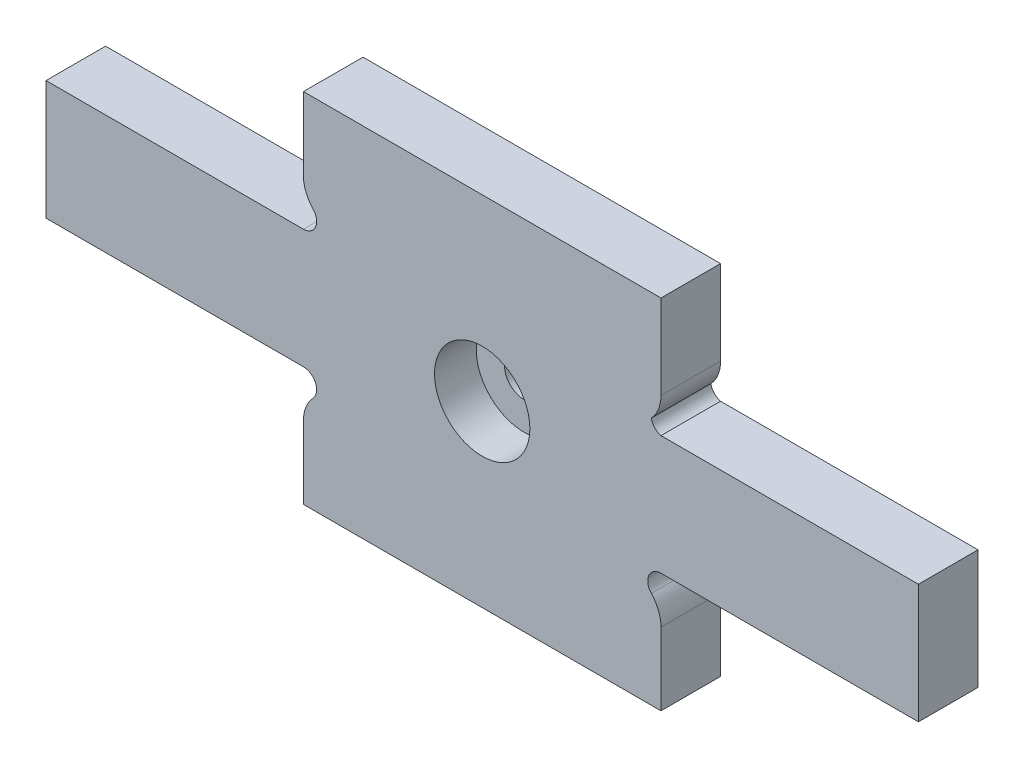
ISO-10303-21;
HEADER;
FILE_DESCRIPTION(('STEP AP214'),'2;1');
FILE_NAME('part.step','',(''),(''),'','','');
FILE_SCHEMA(('AUTOMOTIVE_DESIGN { 1 0 10303 214 1 1 1 1 }'));
ENDSEC;
DATA;
#1=APPLICATION_CONTEXT('core data for automotive mechanical design processes');
#2=APPLICATION_PROTOCOL_DEFINITION('international standard','automotive_design',2000,#1);
#3=PRODUCT_CONTEXT('',#1,'mechanical');
#4=PRODUCT('Part','Part','',(#3));
#5=PRODUCT_RELATED_PRODUCT_CATEGORY('part','',(#4));
#6=PRODUCT_DEFINITION_FORMATION('','',#4);
#7=PRODUCT_DEFINITION_CONTEXT('part definition',#1,'design');
#8=PRODUCT_DEFINITION('design','',#6,#7);
#9=PRODUCT_DEFINITION_SHAPE('','',#8);
#10=(LENGTH_UNIT() NAMED_UNIT(*) SI_UNIT(.MILLI.,.METRE.));
#11=(NAMED_UNIT(*) PLANE_ANGLE_UNIT() SI_UNIT($,.RADIAN.));
#12=(NAMED_UNIT(*) SI_UNIT($,.STERADIAN.) SOLID_ANGLE_UNIT());
#13=UNCERTAINTY_MEASURE_WITH_UNIT(LENGTH_MEASURE(1.E-05),#10,'distance_accuracy_value','');
#14=(GEOMETRIC_REPRESENTATION_CONTEXT(3) GLOBAL_UNCERTAINTY_ASSIGNED_CONTEXT((#13)) GLOBAL_UNIT_ASSIGNED_CONTEXT((#10,
#11,#12)) REPRESENTATION_CONTEXT('',''));
#15=CARTESIAN_POINT('',(0.,0.,0.));
#16=DIRECTION('',(0.,0.,1.));
#17=DIRECTION('',(1.,0.,0.));
#18=AXIS2_PLACEMENT_3D('',#15,#16,#17);
#19=CARTESIAN_POINT('',(0.,0.,0.));
#20=DIRECTION('',(0.,0.,1.));
#21=DIRECTION('',(1.,0.,0.));
#22=AXIS2_PLACEMENT_3D('',#19,#20,#21);
#23=CYLINDRICAL_SURFACE('',#22,3.25);
#24=CARTESIAN_POINT('',(0.,0.,0.));
#25=DIRECTION('',(0.,0.,1.));
#26=DIRECTION('',(1.,0.,0.));
#27=AXIS2_PLACEMENT_3D('',#24,#25,#26);
#28=CIRCLE('',#27,3.25);
#29=CARTESIAN_POINT('',(3.25,0.,0.));
#30=VERTEX_POINT('',#29);
#31=EDGE_CURVE('E225',#30,#30,#28,.T.);
#32=ORIENTED_EDGE('',*,*,#31,.F.);
#33=EDGE_LOOP('',(#32));
#34=FACE_BOUND('',#33,.T.);
#35=CARTESIAN_POINT('',(0.,0.,3.));
#36=DIRECTION('',(0.,0.,1.));
#37=DIRECTION('',(1.,0.,0.));
#38=AXIS2_PLACEMENT_3D('',#35,#36,#37);
#39=CIRCLE('',#38,3.25);
#40=CARTESIAN_POINT('',(3.25,0.,3.));
#41=VERTEX_POINT('',#40);
#42=EDGE_CURVE('E49',#41,#41,#39,.F.);
#43=ORIENTED_EDGE('',*,*,#42,.F.);
#44=EDGE_LOOP('',(#43));
#45=FACE_BOUND('',#44,.T.);
#46=ADVANCED_FACE('F45',(#34,#45),#23,.F.);
#47=CARTESIAN_POINT('',(30.0000000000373,-12.2200000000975,10.));
#48=DIRECTION('',(0.,0.,-1.));
#49=DIRECTION('',(-1.,0.,0.));
#50=AXIS2_PLACEMENT_3D('',#47,#48,#49);
#51=CYLINDRICAL_SURFACE('',#50,2.22000000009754);
#52=CARTESIAN_POINT('',(30.0000000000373,-12.2200000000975,0.));
#53=DIRECTION('',(0.,0.,-1.));
#54=DIRECTION('',(1.,0.,0.));
#55=AXIS2_PLACEMENT_3D('',#52,#53,#54);
#56=CIRCLE('',#55,2.22000000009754);
#57=CARTESIAN_POINT('',(28.3795620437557,-13.7374257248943,0.));
#58=VERTEX_POINT('',#57);
#59=CARTESIAN_POINT('',(30.0000000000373,-10.,0.));
#60=VERTEX_POINT('',#59);
#61=EDGE_CURVE('E220',#58,#60,#56,.T.);
#62=ORIENTED_EDGE('',*,*,#61,.T.);
#63=DIRECTION('',(0.,0.,-1.));
#64=VECTOR('',#63,1.);
#65=CARTESIAN_POINT('',(30.0000000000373,-10.,10.));
#66=LINE('',#65,#64);
#67=CARTESIAN_POINT('',(30.0000000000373,-10.,10.));
#68=VERTEX_POINT('',#67);
#69=EDGE_CURVE('E11',#68,#60,#66,.T.);
#70=ORIENTED_EDGE('',*,*,#69,.F.);
#71=CARTESIAN_POINT('',(30.0000000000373,-12.2200000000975,10.));
#72=DIRECTION('',(0.,0.,-1.));
#73=DIRECTION('',(1.,0.,0.));
#74=AXIS2_PLACEMENT_3D('',#71,#72,#73);
#75=CIRCLE('',#74,2.22000000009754);
#76=CARTESIAN_POINT('',(28.3795620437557,-13.7374257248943,10.));
#77=VERTEX_POINT('',#76);
#78=EDGE_CURVE('E279',#77,#68,#75,.T.);
#79=ORIENTED_EDGE('',*,*,#78,.F.);
#80=DIRECTION('',(0.,0.,-1.));
#81=VECTOR('',#80,1.);
#82=CARTESIAN_POINT('',(28.3795620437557,-13.7374257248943,10.));
#83=LINE('',#82,#81);
#84=EDGE_CURVE('E216',#77,#58,#83,.T.);
#85=ORIENTED_EDGE('',*,*,#84,.T.);
#86=EDGE_LOOP('',(#62,#70,#79,#85));
#87=FACE_BOUND('',#86,.T.);
#88=ADVANCED_FACE('F47',(#87),#51,.F.);
#89=CARTESIAN_POINT('',(30.0000000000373,-10.,10.));
#90=DIRECTION('',(0.,1.,0.));
#91=DIRECTION('',(-1.,0.,0.));
#92=AXIS2_PLACEMENT_3D('',#89,#90,#91);
#93=PLANE('',#92);
#94=DIRECTION('',(1.,0.,0.));
#95=VECTOR('',#94,1.);
#96=CARTESIAN_POINT('',(30.0000000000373,-10.,0.));
#97=LINE('',#96,#95);
#98=CARTESIAN_POINT('',(73.2000000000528,-9.99999999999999,0.));
#99=VERTEX_POINT('',#98);
#100=EDGE_CURVE('E224',#60,#99,#97,.T.);
#101=ORIENTED_EDGE('',*,*,#100,.T.);
#102=DIRECTION('',(0.,0.,-1.));
#103=VECTOR('',#102,1.);
#104=CARTESIAN_POINT('',(73.2000000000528,-9.99999999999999,10.));
#105=LINE('',#104,#103);
#106=CARTESIAN_POINT('',(73.2000000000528,-9.99999999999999,10.));
#107=VERTEX_POINT('',#106);
#108=EDGE_CURVE('E56',#107,#99,#105,.T.);
#109=ORIENTED_EDGE('',*,*,#108,.F.);
#110=DIRECTION('',(1.,0.,0.));
#111=VECTOR('',#110,1.);
#112=CARTESIAN_POINT('',(30.0000000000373,-10.,10.));
#113=LINE('',#112,#111);
#114=EDGE_CURVE('E143',#68,#107,#113,.T.);
#115=ORIENTED_EDGE('',*,*,#114,.F.);
#116=ORIENTED_EDGE('',*,*,#69,.T.);
#117=EDGE_LOOP('',(#101,#109,#115,#116));
#118=FACE_BOUND('',#117,.T.);
#119=ADVANCED_FACE('F437',(#118),#93,.F.);
#120=CARTESIAN_POINT('',(73.2000000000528,-9.99999999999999,10.));
#121=DIRECTION('',(-1.,0.,0.));
#122=DIRECTION('',(0.,0.,1.));
#123=AXIS2_PLACEMENT_3D('',#120,#121,#122);
#124=PLANE('',#123);
#125=DIRECTION('',(0.,1.,0.));
#126=VECTOR('',#125,1.);
#127=CARTESIAN_POINT('',(73.2000000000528,-9.99999999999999,0.));
#128=LINE('',#127,#126);
#129=CARTESIAN_POINT('',(73.2000000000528,10.,0.));
#130=VERTEX_POINT('',#129);
#131=EDGE_CURVE('E228',#99,#130,#128,.T.);
#132=ORIENTED_EDGE('',*,*,#131,.T.);
#133=DIRECTION('',(0.,0.,-1.));
#134=VECTOR('',#133,1.);
#135=CARTESIAN_POINT('',(73.2000000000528,10.,10.));
#136=LINE('',#135,#134);
#137=CARTESIAN_POINT('',(73.2000000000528,10.,10.));
#138=VERTEX_POINT('',#137);
#139=EDGE_CURVE('E338',#138,#130,#136,.T.);
#140=ORIENTED_EDGE('',*,*,#139,.F.);
#141=DIRECTION('',(0.,1.,0.));
#142=VECTOR('',#141,1.);
#143=CARTESIAN_POINT('',(73.2000000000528,-9.99999999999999,10.));
#144=LINE('',#143,#142);
#145=EDGE_CURVE('E349',#107,#138,#144,.T.);
#146=ORIENTED_EDGE('',*,*,#145,.F.);
#147=ORIENTED_EDGE('',*,*,#108,.T.);
#148=EDGE_LOOP('',(#132,#140,#146,#147));
#149=FACE_BOUND('',#148,.T.);
#150=ADVANCED_FACE('F347',(#149),#124,.F.);
#151=CARTESIAN_POINT('',(73.2000000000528,10.,10.));
#152=DIRECTION('',(0.,-1.,0.));
#153=DIRECTION('',(1.,0.,0.));
#154=AXIS2_PLACEMENT_3D('',#151,#152,#153);
#155=PLANE('',#154);
#156=DIRECTION('',(-1.,0.,0.));
#157=VECTOR('',#156,1.);
#158=CARTESIAN_POINT('',(73.2000000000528,10.,0.));
#159=LINE('',#158,#157);
#160=CARTESIAN_POINT('',(30.0000000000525,10.,0.));
#161=VERTEX_POINT('',#160);
#162=EDGE_CURVE('E231',#130,#161,#159,.T.);
#163=ORIENTED_EDGE('',*,*,#162,.T.);
#164=DIRECTION('',(0.,0.,-1.));
#165=VECTOR('',#164,1.);
#166=CARTESIAN_POINT('',(30.0000000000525,10.,10.));
#167=LINE('',#166,#165);
#168=CARTESIAN_POINT('',(30.0000000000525,10.,10.));
#169=VERTEX_POINT('',#168);
#170=EDGE_CURVE('E334',#169,#161,#167,.T.);
#171=ORIENTED_EDGE('',*,*,#170,.F.);
#172=DIRECTION('',(-1.,0.,0.));
#173=VECTOR('',#172,1.);
#174=CARTESIAN_POINT('',(73.2000000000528,10.,10.));
#175=LINE('',#174,#173);
#176=EDGE_CURVE('E368',#138,#169,#175,.T.);
#177=ORIENTED_EDGE('',*,*,#176,.F.);
#178=ORIENTED_EDGE('',*,*,#139,.T.);
#179=EDGE_LOOP('',(#163,#171,#177,#178));
#180=FACE_BOUND('',#179,.T.);
#181=ADVANCED_FACE('F358',(#180),#155,.F.);
#182=CARTESIAN_POINT('',(30.5612892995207,12.1478720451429,10.));
#183=DIRECTION('',(0.,0.,-1.));
#184=DIRECTION('',(-1.,0.,0.));
#185=AXIS2_PLACEMENT_3D('',#182,#183,#184);
#186=CYLINDRICAL_SURFACE('',#185,2.22000000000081);
#187=CARTESIAN_POINT('',(30.5612892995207,12.1478720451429,0.));
#188=DIRECTION('',(0.,0.,-1.));
#189=DIRECTION('',(1.,0.,0.));
#190=AXIS2_PLACEMENT_3D('',#187,#188,#189);
#191=CIRCLE('',#190,2.22000000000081);
#192=CARTESIAN_POINT('',(28.3795620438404,11.7374257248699,0.));
#193=VERTEX_POINT('',#192);
#194=EDGE_CURVE('E234',#161,#193,#191,.T.);
#195=ORIENTED_EDGE('',*,*,#194,.T.);
#196=DIRECTION('',(0.,0.,-1.));
#197=VECTOR('',#196,1.);
#198=CARTESIAN_POINT('',(28.3795620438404,11.7374257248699,10.));
#199=LINE('',#198,#197);
#200=CARTESIAN_POINT('',(28.3795620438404,11.7374257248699,10.));
#201=VERTEX_POINT('',#200);
#202=EDGE_CURVE('E330',#201,#193,#199,.T.);
#203=ORIENTED_EDGE('',*,*,#202,.F.);
#204=CARTESIAN_POINT('',(30.5612892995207,12.1478720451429,10.));
#205=DIRECTION('',(0.,0.,-1.));
#206=DIRECTION('',(1.,0.,0.));
#207=AXIS2_PLACEMENT_3D('',#204,#205,#206);
#208=CIRCLE('',#207,2.22000000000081);
#209=EDGE_CURVE('E364',#169,#201,#208,.T.);
#210=ORIENTED_EDGE('',*,*,#209,.F.);
#211=ORIENTED_EDGE('',*,*,#170,.T.);
#212=EDGE_LOOP('',(#195,#203,#210,#211));
#213=FACE_BOUND('',#212,.T.);
#214=ADVANCED_FACE('F362',(#213),#186,.F.);
#215=CARTESIAN_POINT('',(24.0000000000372,15.8385763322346,10.));
#216=DIRECTION('',(0.,0.,-1.));
#217=DIRECTION('',(-1.,0.,0.));
#218=AXIS2_PLACEMENT_3D('',#215,#216,#217);
#219=CYLINDRICAL_SURFACE('',#218,5.99999999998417);
#220=CARTESIAN_POINT('',(24.0000000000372,15.8385763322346,0.));
#221=DIRECTION('',(0.,0.,1.));
#222=DIRECTION('',(1.,0.,0.));
#223=AXIS2_PLACEMENT_3D('',#220,#221,#222);
#224=CIRCLE('',#223,5.99999999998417);
#225=CARTESIAN_POINT('',(30.0000000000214,15.8385763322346,0.));
#226=VERTEX_POINT('',#225);
#227=EDGE_CURVE('E237',#193,#226,#224,.T.);
#228=ORIENTED_EDGE('',*,*,#227,.T.);
#229=DIRECTION('',(0.,0.,-1.));
#230=VECTOR('',#229,1.);
#231=CARTESIAN_POINT('',(30.0000000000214,15.8385763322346,10.));
#232=LINE('',#231,#230);
#233=CARTESIAN_POINT('',(30.0000000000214,15.8385763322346,10.));
#234=VERTEX_POINT('',#233);
#235=EDGE_CURVE('E326',#234,#226,#232,.T.);
#236=ORIENTED_EDGE('',*,*,#235,.F.);
#237=CARTESIAN_POINT('',(24.0000000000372,15.8385763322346,10.));
#238=DIRECTION('',(0.,0.,1.));
#239=DIRECTION('',(1.,0.,0.));
#240=AXIS2_PLACEMENT_3D('',#237,#238,#239);
#241=CIRCLE('',#240,5.99999999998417);
#242=EDGE_CURVE('E367',#201,#234,#241,.T.);
#243=ORIENTED_EDGE('',*,*,#242,.F.);
#244=ORIENTED_EDGE('',*,*,#202,.T.);
#245=EDGE_LOOP('',(#228,#236,#243,#244));
#246=FACE_BOUND('',#245,.T.);
#247=ADVANCED_FACE('F620',(#246),#219,.T.);
#248=CARTESIAN_POINT('',(30.0000000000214,15.8385763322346,10.));
#249=DIRECTION('',(-1.,0.,0.));
#250=DIRECTION('',(0.,0.,1.));
#251=AXIS2_PLACEMENT_3D('',#248,#249,#250);
#252=PLANE('',#251);
#253=DIRECTION('',(0.,1.,0.));
#254=VECTOR('',#253,1.);
#255=CARTESIAN_POINT('',(30.0000000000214,15.8385763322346,0.));
#256=LINE('',#255,#254);
#257=CARTESIAN_POINT('',(30.0000000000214,30.,0.));
#258=VERTEX_POINT('',#257);
#259=EDGE_CURVE('E240',#226,#258,#256,.T.);
#260=ORIENTED_EDGE('',*,*,#259,.T.);
#261=DIRECTION('',(0.,0.,-1.));
#262=VECTOR('',#261,1.);
#263=CARTESIAN_POINT('',(30.0000000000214,30.,10.));
#264=LINE('',#263,#262);
#265=CARTESIAN_POINT('',(30.0000000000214,30.,10.));
#266=VERTEX_POINT('',#265);
#267=EDGE_CURVE('E322',#266,#258,#264,.T.);
#268=ORIENTED_EDGE('',*,*,#267,.F.);
#269=DIRECTION('',(0.,1.,0.));
#270=VECTOR('',#269,1.);
#271=CARTESIAN_POINT('',(30.0000000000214,15.8385763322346,10.));
#272=LINE('',#271,#270);
#273=EDGE_CURVE('E372',#234,#266,#272,.T.);
#274=ORIENTED_EDGE('',*,*,#273,.F.);
#275=ORIENTED_EDGE('',*,*,#235,.T.);
#276=EDGE_LOOP('',(#260,#268,#274,#275));
#277=FACE_BOUND('',#276,.T.);
#278=ADVANCED_FACE('F610',(#277),#252,.F.);
#279=CARTESIAN_POINT('',(30.0000000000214,30.,10.));
#280=DIRECTION('',(0.,-1.,0.));
#281=DIRECTION('',(0.,0.,-1.));
#282=AXIS2_PLACEMENT_3D('',#279,#280,#281);
#283=PLANE('',#282);
#284=DIRECTION('',(-1.,0.,0.));
#285=VECTOR('',#284,1.);
#286=CARTESIAN_POINT('',(30.0000000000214,30.,0.));
#287=LINE('',#286,#285);
#288=CARTESIAN_POINT('',(-30.,30.,0.));
#289=VERTEX_POINT('',#288);
#290=EDGE_CURVE('E243',#258,#289,#287,.T.);
#291=ORIENTED_EDGE('',*,*,#290,.T.);
#292=DIRECTION('',(0.,0.,-1.));
#293=VECTOR('',#292,1.);
#294=CARTESIAN_POINT('',(-30.,30.,10.));
#295=LINE('',#294,#293);
#296=CARTESIAN_POINT('',(-30.,30.,10.));
#297=VERTEX_POINT('',#296);
#298=EDGE_CURVE('E318',#297,#289,#295,.T.);
#299=ORIENTED_EDGE('',*,*,#298,.F.);
#300=DIRECTION('',(-1.,0.,0.));
#301=VECTOR('',#300,1.);
#302=CARTESIAN_POINT('',(30.0000000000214,30.,10.));
#303=LINE('',#302,#301);
#304=EDGE_CURVE('E379',#266,#297,#303,.T.);
#305=ORIENTED_EDGE('',*,*,#304,.F.);
#306=ORIENTED_EDGE('',*,*,#267,.T.);
#307=EDGE_LOOP('',(#291,#299,#305,#306));
#308=FACE_BOUND('',#307,.T.);
#309=ADVANCED_FACE('F600',(#308),#283,.F.);
#310=CARTESIAN_POINT('',(-30.,30.,10.));
#311=DIRECTION('',(1.,0.,0.));
#312=DIRECTION('',(0.,0.,-1.));
#313=AXIS2_PLACEMENT_3D('',#310,#311,#312);
#314=PLANE('',#313);
#315=DIRECTION('',(0.,-1.,0.));
#316=VECTOR('',#315,1.);
#317=CARTESIAN_POINT('',(-30.,30.,0.));
#318=LINE('',#317,#316);
#319=CARTESIAN_POINT('',(-30.,17.3740036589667,0.));
#320=VERTEX_POINT('',#319);
#321=EDGE_CURVE('E246',#289,#320,#318,.T.);
#322=ORIENTED_EDGE('',*,*,#321,.T.);
#323=DIRECTION('',(0.,0.,-1.));
#324=VECTOR('',#323,1.);
#325=CARTESIAN_POINT('',(-30.,17.3740036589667,10.));
#326=LINE('',#325,#324);
#327=CARTESIAN_POINT('',(-30.,17.3740036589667,10.));
#328=VERTEX_POINT('',#327);
#329=EDGE_CURVE('E314',#328,#320,#326,.T.);
#330=ORIENTED_EDGE('',*,*,#329,.F.);
#331=DIRECTION('',(0.,-1.,0.));
#332=VECTOR('',#331,1.);
#333=CARTESIAN_POINT('',(-30.,30.,10.));
#334=LINE('',#333,#332);
#335=EDGE_CURVE('E382',#297,#328,#334,.T.);
#336=ORIENTED_EDGE('',*,*,#335,.F.);
#337=ORIENTED_EDGE('',*,*,#298,.T.);
#338=EDGE_LOOP('',(#322,#330,#336,#337));
#339=FACE_BOUND('',#338,.T.);
#340=ADVANCED_FACE('F590',(#339),#314,.F.);
#341=CARTESIAN_POINT('',(-24.0196732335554,17.8594846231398,10.));
#342=DIRECTION('',(0.,0.,-1.));
#343=DIRECTION('',(-1.,0.,0.));
#344=AXIS2_PLACEMENT_3D('',#341,#342,#343);
#345=CYLINDRICAL_SURFACE('',#344,6.00000000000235);
#346=CARTESIAN_POINT('',(-24.0196732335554,17.8594846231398,0.));
#347=DIRECTION('',(0.,0.,1.));
#348=DIRECTION('',(1.,0.,0.));
#349=AXIS2_PLACEMENT_3D('',#346,#347,#348);
#350=CIRCLE('',#349,6.00000000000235);
#351=CARTESIAN_POINT('',(-28.3795620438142,13.7374257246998,0.));
#352=VERTEX_POINT('',#351);
#353=EDGE_CURVE('E249',#320,#352,#350,.T.);
#354=ORIENTED_EDGE('',*,*,#353,.T.);
#355=DIRECTION('',(0.,0.,-1.));
#356=VECTOR('',#355,1.);
#357=CARTESIAN_POINT('',(-28.3795620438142,13.7374257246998,10.));
#358=LINE('',#357,#356);
#359=CARTESIAN_POINT('',(-28.3795620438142,13.7374257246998,10.));
#360=VERTEX_POINT('',#359);
#361=EDGE_CURVE('E310',#360,#352,#358,.T.);
#362=ORIENTED_EDGE('',*,*,#361,.F.);
#363=CARTESIAN_POINT('',(-24.0196732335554,17.8594846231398,10.));
#364=DIRECTION('',(0.,0.,1.));
#365=DIRECTION('',(1.,0.,0.));
#366=AXIS2_PLACEMENT_3D('',#363,#364,#365);
#367=CIRCLE('',#366,6.00000000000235);
#368=EDGE_CURVE('E385',#328,#360,#367,.T.);
#369=ORIENTED_EDGE('',*,*,#368,.F.);
#370=ORIENTED_EDGE('',*,*,#329,.T.);
#371=EDGE_LOOP('',(#354,#362,#369,#370));
#372=FACE_BOUND('',#371,.T.);
#373=ADVANCED_FACE('F580',(#372),#345,.T.);
#374=CARTESIAN_POINT('',(-30.000000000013,12.2199999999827,10.));
#375=DIRECTION('',(0.,0.,-1.));
#376=DIRECTION('',(-1.,0.,0.));
#377=AXIS2_PLACEMENT_3D('',#374,#375,#376);
#378=CYLINDRICAL_SURFACE('',#377,2.21999999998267);
#379=CARTESIAN_POINT('',(-30.000000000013,12.2199999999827,0.));
#380=DIRECTION('',(0.,0.,-1.));
#381=DIRECTION('',(1.,0.,0.));
#382=AXIS2_PLACEMENT_3D('',#379,#380,#381);
#383=CIRCLE('',#382,2.21999999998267);
#384=CARTESIAN_POINT('',(-30.000000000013,10.,0.));
#385=VERTEX_POINT('',#384);
#386=EDGE_CURVE('E252',#352,#385,#383,.T.);
#387=ORIENTED_EDGE('',*,*,#386,.T.);
#388=DIRECTION('',(0.,0.,-1.));
#389=VECTOR('',#388,1.);
#390=CARTESIAN_POINT('',(-30.000000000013,10.,10.));
#391=LINE('',#390,#389);
#392=CARTESIAN_POINT('',(-30.000000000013,10.,10.));
#393=VERTEX_POINT('',#392);
#394=EDGE_CURVE('E306',#393,#385,#391,.T.);
#395=ORIENTED_EDGE('',*,*,#394,.F.);
#396=CARTESIAN_POINT('',(-30.000000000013,12.2199999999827,10.));
#397=DIRECTION('',(0.,0.,-1.));
#398=DIRECTION('',(1.,0.,0.));
#399=AXIS2_PLACEMENT_3D('',#396,#397,#398);
#400=CIRCLE('',#399,2.21999999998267);
#401=EDGE_CURVE('E388',#360,#393,#400,.T.);
#402=ORIENTED_EDGE('',*,*,#401,.F.);
#403=ORIENTED_EDGE('',*,*,#361,.T.);
#404=EDGE_LOOP('',(#387,#395,#402,#403));
#405=FACE_BOUND('',#404,.T.);
#406=ADVANCED_FACE('F570',(#405),#378,.F.);
#407=CARTESIAN_POINT('',(-30.000000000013,10.,10.));
#408=DIRECTION('',(0.,-1.,0.));
#409=DIRECTION('',(0.,0.,-1.));
#410=AXIS2_PLACEMENT_3D('',#407,#408,#409);
#411=PLANE('',#410);
#412=DIRECTION('',(-1.,0.,0.));
#413=VECTOR('',#412,1.);
#414=CARTESIAN_POINT('',(-30.000000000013,10.,0.));
#415=LINE('',#414,#413);
#416=CARTESIAN_POINT('',(-73.2000000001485,10.,0.));
#417=VERTEX_POINT('',#416);
#418=EDGE_CURVE('E255',#385,#417,#415,.T.);
#419=ORIENTED_EDGE('',*,*,#418,.T.);
#420=DIRECTION('',(0.,0.,-1.));
#421=VECTOR('',#420,1.);
#422=CARTESIAN_POINT('',(-73.2000000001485,10.,10.));
#423=LINE('',#422,#421);
#424=CARTESIAN_POINT('',(-73.2000000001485,10.,10.));
#425=VERTEX_POINT('',#424);
#426=EDGE_CURVE('E302',#425,#417,#423,.T.);
#427=ORIENTED_EDGE('',*,*,#426,.F.);
#428=DIRECTION('',(-1.,0.,0.));
#429=VECTOR('',#428,1.);
#430=CARTESIAN_POINT('',(-30.000000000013,10.,10.));
#431=LINE('',#430,#429);
#432=EDGE_CURVE('E391',#393,#425,#431,.T.);
#433=ORIENTED_EDGE('',*,*,#432,.F.);
#434=ORIENTED_EDGE('',*,*,#394,.T.);
#435=EDGE_LOOP('',(#419,#427,#433,#434));
#436=FACE_BOUND('',#435,.T.);
#437=ADVANCED_FACE('F560',(#436),#411,.F.);
#438=CARTESIAN_POINT('',(-73.2000000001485,10.,10.));
#439=DIRECTION('',(1.,0.,0.));
#440=DIRECTION('',(0.,1.,0.));
#441=AXIS2_PLACEMENT_3D('',#438,#439,#440);
#442=PLANE('',#441);
#443=DIRECTION('',(0.,-1.,0.));
#444=VECTOR('',#443,1.);
#445=CARTESIAN_POINT('',(-73.2000000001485,10.,0.));
#446=LINE('',#445,#444);
#447=CARTESIAN_POINT('',(-73.2000000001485,-10.,0.));
#448=VERTEX_POINT('',#447);
#449=EDGE_CURVE('E258',#417,#448,#446,.T.);
#450=ORIENTED_EDGE('',*,*,#449,.T.);
#451=DIRECTION('',(0.,0.,-1.));
#452=VECTOR('',#451,1.);
#453=CARTESIAN_POINT('',(-73.2000000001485,-10.,10.));
#454=LINE('',#453,#452);
#455=CARTESIAN_POINT('',(-73.2000000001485,-10.,10.));
#456=VERTEX_POINT('',#455);
#457=EDGE_CURVE('E298',#456,#448,#454,.T.);
#458=ORIENTED_EDGE('',*,*,#457,.F.);
#459=DIRECTION('',(0.,-1.,0.));
#460=VECTOR('',#459,1.);
#461=CARTESIAN_POINT('',(-73.2000000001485,10.,10.));
#462=LINE('',#461,#460);
#463=EDGE_CURVE('E394',#425,#456,#462,.T.);
#464=ORIENTED_EDGE('',*,*,#463,.F.);
#465=ORIENTED_EDGE('',*,*,#426,.T.);
#466=EDGE_LOOP('',(#450,#458,#464,#465));
#467=FACE_BOUND('',#466,.T.);
#468=ADVANCED_FACE('F550',(#467),#442,.F.);
#469=CARTESIAN_POINT('',(-73.2000000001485,-10.,10.));
#470=DIRECTION('',(0.,1.,0.));
#471=DIRECTION('',(-1.,0.,0.));
#472=AXIS2_PLACEMENT_3D('',#469,#470,#471);
#473=PLANE('',#472);
#474=DIRECTION('',(1.,0.,0.));
#475=VECTOR('',#474,1.);
#476=CARTESIAN_POINT('',(-73.2000000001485,-10.,0.));
#477=LINE('',#476,#475);
#478=CARTESIAN_POINT('',(-30.000000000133,-9.99999999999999,0.));
#479=VERTEX_POINT('',#478);
#480=EDGE_CURVE('E261',#448,#479,#477,.T.);
#481=ORIENTED_EDGE('',*,*,#480,.T.);
#482=DIRECTION('',(0.,0.,-1.));
#483=VECTOR('',#482,1.);
#484=CARTESIAN_POINT('',(-30.000000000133,-9.99999999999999,10.));
#485=LINE('',#484,#483);
#486=CARTESIAN_POINT('',(-30.000000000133,-9.99999999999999,10.));
#487=VERTEX_POINT('',#486);
#488=EDGE_CURVE('E294',#487,#479,#485,.T.);
#489=ORIENTED_EDGE('',*,*,#488,.F.);
#490=DIRECTION('',(1.,0.,0.));
#491=VECTOR('',#490,1.);
#492=CARTESIAN_POINT('',(-73.2000000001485,-10.,10.));
#493=LINE('',#492,#491);
#494=EDGE_CURVE('E397',#456,#487,#493,.T.);
#495=ORIENTED_EDGE('',*,*,#494,.F.);
#496=ORIENTED_EDGE('',*,*,#457,.T.);
#497=EDGE_LOOP('',(#481,#489,#495,#496));
#498=FACE_BOUND('',#497,.T.);
#499=ADVANCED_FACE('F540',(#498),#473,.F.);
#500=CARTESIAN_POINT('',(-30.000000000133,-12.2200000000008,10.));
#501=DIRECTION('',(0.,0.,-1.));
#502=DIRECTION('',(-1.,0.,0.));
#503=AXIS2_PLACEMENT_3D('',#500,#501,#502);
#504=CYLINDRICAL_SURFACE('',#503,2.22000000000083);
#505=CARTESIAN_POINT('',(-30.000000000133,-12.2200000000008,0.));
#506=DIRECTION('',(0.,0.,-1.));
#507=DIRECTION('',(1.,0.,0.));
#508=AXIS2_PLACEMENT_3D('',#505,#506,#507);
#509=CIRCLE('',#508,2.22000000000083);
#510=CARTESIAN_POINT('',(-28.3795620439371,-13.7374257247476,0.));
#511=VERTEX_POINT('',#510);
#512=EDGE_CURVE('E264',#479,#511,#509,.T.);
#513=ORIENTED_EDGE('',*,*,#512,.T.);
#514=DIRECTION('',(0.,0.,-1.));
#515=VECTOR('',#514,1.);
#516=CARTESIAN_POINT('',(-28.3795620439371,-13.7374257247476,10.));
#517=LINE('',#516,#515);
#518=CARTESIAN_POINT('',(-28.3795620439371,-13.7374257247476,10.));
#519=VERTEX_POINT('',#518);
#520=EDGE_CURVE('E290',#519,#511,#517,.T.);
#521=ORIENTED_EDGE('',*,*,#520,.F.);
#522=CARTESIAN_POINT('',(-30.000000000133,-12.2200000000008,10.));
#523=DIRECTION('',(0.,0.,-1.));
#524=DIRECTION('',(1.,0.,0.));
#525=AXIS2_PLACEMENT_3D('',#522,#523,#524);
#526=CIRCLE('',#525,2.22000000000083);
#527=EDGE_CURVE('E400',#487,#519,#526,.T.);
#528=ORIENTED_EDGE('',*,*,#527,.F.);
#529=ORIENTED_EDGE('',*,*,#488,.T.);
#530=EDGE_LOOP('',(#513,#521,#528,#529));
#531=FACE_BOUND('',#530,.T.);
#532=ADVANCED_FACE('F531',(#531),#504,.F.);
#533=CARTESIAN_POINT('',(-24.0000000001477,-17.8385763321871,10.));
#534=DIRECTION('',(0.,0.,-1.));
#535=DIRECTION('',(-1.,0.,0.));
#536=AXIS2_PLACEMENT_3D('',#533,#534,#535);
#537=CYLINDRICAL_SURFACE('',#536,6.00000000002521);
#538=CARTESIAN_POINT('',(-24.0000000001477,-17.8385763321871,0.));
#539=DIRECTION('',(0.,0.,1.));
#540=DIRECTION('',(1.,0.,0.));
#541=AXIS2_PLACEMENT_3D('',#538,#539,#540);
#542=CIRCLE('',#541,6.00000000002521);
#543=CARTESIAN_POINT('',(-30.0000000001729,-17.8385763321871,0.));
#544=VERTEX_POINT('',#543);
#545=EDGE_CURVE('E267',#511,#544,#542,.T.);
#546=ORIENTED_EDGE('',*,*,#545,.T.);
#547=DIRECTION('',(0.,0.,-1.));
#548=VECTOR('',#547,1.);
#549=CARTESIAN_POINT('',(-30.0000000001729,-17.8385763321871,10.));
#550=LINE('',#549,#548);
#551=CARTESIAN_POINT('',(-30.0000000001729,-17.8385763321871,10.));
#552=VERTEX_POINT('',#551);
#553=EDGE_CURVE('E286',#552,#544,#550,.T.);
#554=ORIENTED_EDGE('',*,*,#553,.F.);
#555=CARTESIAN_POINT('',(-24.0000000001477,-17.8385763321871,10.));
#556=DIRECTION('',(0.,0.,1.));
#557=DIRECTION('',(1.,0.,0.));
#558=AXIS2_PLACEMENT_3D('',#555,#556,#557);
#559=CIRCLE('',#558,6.00000000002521);
#560=EDGE_CURVE('E403',#519,#552,#559,.T.);
#561=ORIENTED_EDGE('',*,*,#560,.F.);
#562=ORIENTED_EDGE('',*,*,#520,.T.);
#563=EDGE_LOOP('',(#546,#554,#561,#562));
#564=FACE_BOUND('',#563,.T.);
#565=ADVANCED_FACE('F411',(#564),#537,.T.);
#566=CARTESIAN_POINT('',(-30.0000000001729,-17.8385763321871,10.));
#567=DIRECTION('',(1.,0.,0.));
#568=DIRECTION('',(0.,0.,-1.));
#569=AXIS2_PLACEMENT_3D('',#566,#567,#568);
#570=PLANE('',#569);
#571=DIRECTION('',(0.,-1.,0.));
#572=VECTOR('',#571,1.);
#573=CARTESIAN_POINT('',(-30.0000000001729,-17.8385763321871,0.));
#574=LINE('',#573,#572);
#575=CARTESIAN_POINT('',(-30.0000000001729,-30.,0.));
#576=VERTEX_POINT('',#575);
#577=EDGE_CURVE('E270',#544,#576,#574,.T.);
#578=ORIENTED_EDGE('',*,*,#577,.T.);
#579=DIRECTION('',(0.,0.,-1.));
#580=VECTOR('',#579,1.);
#581=CARTESIAN_POINT('',(-30.0000000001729,-30.,10.));
#582=LINE('',#581,#580);
#583=CARTESIAN_POINT('',(-30.0000000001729,-30.,10.));
#584=VERTEX_POINT('',#583);
#585=EDGE_CURVE('E209',#584,#576,#582,.T.);
#586=ORIENTED_EDGE('',*,*,#585,.F.);
#587=DIRECTION('',(0.,-1.,0.));
#588=VECTOR('',#587,1.);
#589=CARTESIAN_POINT('',(-30.0000000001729,-17.8385763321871,10.));
#590=LINE('',#589,#588);
#591=EDGE_CURVE('E198',#552,#584,#590,.T.);
#592=ORIENTED_EDGE('',*,*,#591,.F.);
#593=ORIENTED_EDGE('',*,*,#553,.T.);
#594=EDGE_LOOP('',(#578,#586,#592,#593));
#595=FACE_BOUND('',#594,.T.);
#596=ADVANCED_FACE('F415',(#595),#570,.F.);
#597=CARTESIAN_POINT('',(-30.0000000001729,-30.,10.));
#598=DIRECTION('',(0.,1.,0.));
#599=DIRECTION('',(-1.,0.,0.));
#600=AXIS2_PLACEMENT_3D('',#597,#598,#599);
#601=PLANE('',#600);
#602=DIRECTION('',(1.,0.,0.));
#603=VECTOR('',#602,1.);
#604=CARTESIAN_POINT('',(-30.0000000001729,-30.,0.));
#605=LINE('',#604,#603);
#606=CARTESIAN_POINT('',(29.9999999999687,-30.,0.));
#607=VERTEX_POINT('',#606);
#608=EDGE_CURVE('E207',#576,#607,#605,.T.);
#609=ORIENTED_EDGE('',*,*,#608,.T.);
#610=DIRECTION('',(0.,0.,-1.));
#611=VECTOR('',#610,1.);
#612=CARTESIAN_POINT('',(29.9999999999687,-30.,10.));
#613=LINE('',#612,#611);
#614=CARTESIAN_POINT('',(29.9999999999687,-30.,10.));
#615=VERTEX_POINT('',#614);
#616=EDGE_CURVE('E204',#615,#607,#613,.T.);
#617=ORIENTED_EDGE('',*,*,#616,.F.);
#618=DIRECTION('',(1.,0.,0.));
#619=VECTOR('',#618,1.);
#620=CARTESIAN_POINT('',(-30.0000000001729,-30.,10.));
#621=LINE('',#620,#619);
#622=EDGE_CURVE('E192',#584,#615,#621,.T.);
#623=ORIENTED_EDGE('',*,*,#622,.F.);
#624=ORIENTED_EDGE('',*,*,#585,.T.);
#625=EDGE_LOOP('',(#609,#617,#623,#624));
#626=FACE_BOUND('',#625,.T.);
#627=ADVANCED_FACE('F205',(#626),#601,.F.);
#628=CARTESIAN_POINT('',(29.9999999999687,-30.,10.));
#629=DIRECTION('',(-1.,0.,0.));
#630=DIRECTION('',(0.,-1.,0.));
#631=AXIS2_PLACEMENT_3D('',#628,#629,#630);
#632=PLANE('',#631);
#633=DIRECTION('',(0.,1.,0.));
#634=VECTOR('',#633,1.);
#635=CARTESIAN_POINT('',(29.9999999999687,-30.,0.));
#636=LINE('',#635,#634);
#637=CARTESIAN_POINT('',(29.9999999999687,-17.8385763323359,0.));
#638=VERTEX_POINT('',#637);
#639=EDGE_CURVE('E129',#607,#638,#636,.T.);
#640=ORIENTED_EDGE('',*,*,#639,.T.);
#641=DIRECTION('',(0.,0.,-1.));
#642=VECTOR('',#641,1.);
#643=CARTESIAN_POINT('',(29.9999999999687,-17.8385763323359,10.));
#644=LINE('',#643,#642);
#645=CARTESIAN_POINT('',(29.9999999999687,-17.8385763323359,10.));
#646=VERTEX_POINT('',#645);
#647=EDGE_CURVE('E210',#646,#638,#644,.T.);
#648=ORIENTED_EDGE('',*,*,#647,.F.);
#649=DIRECTION('',(0.,1.,0.));
#650=VECTOR('',#649,1.);
#651=CARTESIAN_POINT('',(29.9999999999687,-30.,10.));
#652=LINE('',#651,#650);
#653=EDGE_CURVE('E196',#615,#646,#652,.T.);
#654=ORIENTED_EDGE('',*,*,#653,.F.);
#655=ORIENTED_EDGE('',*,*,#616,.T.);
#656=EDGE_LOOP('',(#640,#648,#654,#655));
#657=FACE_BOUND('',#656,.T.);
#658=ADVANCED_FACE('F212',(#657),#632,.F.);
#659=CARTESIAN_POINT('',(23.9999999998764,-17.8385763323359,10.));
#660=DIRECTION('',(0.,0.,-1.));
#661=DIRECTION('',(-1.,0.,0.));
#662=AXIS2_PLACEMENT_3D('',#659,#660,#661);
#663=CYLINDRICAL_SURFACE('',#662,6.00000000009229);
#664=CARTESIAN_POINT('',(23.9999999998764,-17.8385763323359,0.));
#665=DIRECTION('',(0.,0.,1.));
#666=DIRECTION('',(1.,0.,0.));
#667=AXIS2_PLACEMENT_3D('',#664,#665,#666);
#668=CIRCLE('',#667,6.00000000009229);
#669=EDGE_CURVE('E135',#638,#58,#668,.T.);
#670=ORIENTED_EDGE('',*,*,#669,.T.);
#671=ORIENTED_EDGE('',*,*,#84,.F.);
#672=CARTESIAN_POINT('',(23.9999999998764,-17.8385763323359,10.));
#673=DIRECTION('',(0.,0.,1.));
#674=DIRECTION('',(1.,0.,0.));
#675=AXIS2_PLACEMENT_3D('',#672,#673,#674);
#676=CIRCLE('',#675,6.00000000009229);
#677=EDGE_CURVE('E64',#646,#77,#676,.T.);
#678=ORIENTED_EDGE('',*,*,#677,.F.);
#679=ORIENTED_EDGE('',*,*,#647,.T.);
#680=EDGE_LOOP('',(#670,#671,#678,#679));
#681=FACE_BOUND('',#680,.T.);
#682=ADVANCED_FACE('F419',(#681),#663,.T.);
#683=CARTESIAN_POINT('',(30.0000000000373,-12.2200000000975,10.));
#684=DIRECTION('',(0.,0.,1.));
#685=DIRECTION('',(1.,0.,0.));
#686=AXIS2_PLACEMENT_3D('',#683,#684,#685);
#687=PLANE('',#686);
#688=CARTESIAN_POINT('',(0.,0.,10.));
#689=DIRECTION('',(0.,0.,1.));
#690=DIRECTION('',(1.,0.,0.));
#691=AXIS2_PLACEMENT_3D('',#688,#689,#690);
#692=CIRCLE('',#691,8.);
#693=CARTESIAN_POINT('',(8.,0.,10.));
#694=VERTEX_POINT('',#693);
#695=EDGE_CURVE('E457',#694,#694,#692,.T.);
#696=ORIENTED_EDGE('',*,*,#695,.F.);
#697=EDGE_LOOP('',(#696));
#698=FACE_BOUND('',#697,.T.);
#699=ORIENTED_EDGE('',*,*,#78,.T.);
#700=ORIENTED_EDGE('',*,*,#114,.T.);
#701=ORIENTED_EDGE('',*,*,#145,.T.);
#702=ORIENTED_EDGE('',*,*,#176,.T.);
#703=ORIENTED_EDGE('',*,*,#209,.T.);
#704=ORIENTED_EDGE('',*,*,#242,.T.);
#705=ORIENTED_EDGE('',*,*,#273,.T.);
#706=ORIENTED_EDGE('',*,*,#304,.T.);
#707=ORIENTED_EDGE('',*,*,#335,.T.);
#708=ORIENTED_EDGE('',*,*,#368,.T.);
#709=ORIENTED_EDGE('',*,*,#401,.T.);
#710=ORIENTED_EDGE('',*,*,#432,.T.);
#711=ORIENTED_EDGE('',*,*,#463,.T.);
#712=ORIENTED_EDGE('',*,*,#494,.T.);
#713=ORIENTED_EDGE('',*,*,#527,.T.);
#714=ORIENTED_EDGE('',*,*,#560,.T.);
#715=ORIENTED_EDGE('',*,*,#591,.T.);
#716=ORIENTED_EDGE('',*,*,#622,.T.);
#717=ORIENTED_EDGE('',*,*,#653,.T.);
#718=ORIENTED_EDGE('',*,*,#677,.T.);
#719=EDGE_LOOP('',(#699,#700,#701,#702,#703,#704,#705,#706,#707,#708,#709,#710,#711,#712,#713,
#714,#715,#716,#717,#718));
#720=FACE_BOUND('',#719,.T.);
#721=ADVANCED_FACE('F194',(#698,#720),#687,.T.);
#722=CARTESIAN_POINT('',(30.0000000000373,-12.2200000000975,0.));
#723=DIRECTION('',(0.,0.,1.));
#724=DIRECTION('',(1.,0.,0.));
#725=AXIS2_PLACEMENT_3D('',#722,#723,#724);
#726=PLANE('',#725);
#727=ORIENTED_EDGE('',*,*,#31,.T.);
#728=EDGE_LOOP('',(#727));
#729=FACE_BOUND('',#728,.T.);
#730=ORIENTED_EDGE('',*,*,#61,.F.);
#731=ORIENTED_EDGE('',*,*,#669,.F.);
#732=ORIENTED_EDGE('',*,*,#639,.F.);
#733=ORIENTED_EDGE('',*,*,#608,.F.);
#734=ORIENTED_EDGE('',*,*,#577,.F.);
#735=ORIENTED_EDGE('',*,*,#545,.F.);
#736=ORIENTED_EDGE('',*,*,#512,.F.);
#737=ORIENTED_EDGE('',*,*,#480,.F.);
#738=ORIENTED_EDGE('',*,*,#449,.F.);
#739=ORIENTED_EDGE('',*,*,#418,.F.);
#740=ORIENTED_EDGE('',*,*,#386,.F.);
#741=ORIENTED_EDGE('',*,*,#353,.F.);
#742=ORIENTED_EDGE('',*,*,#321,.F.);
#743=ORIENTED_EDGE('',*,*,#290,.F.);
#744=ORIENTED_EDGE('',*,*,#259,.F.);
#745=ORIENTED_EDGE('',*,*,#227,.F.);
#746=ORIENTED_EDGE('',*,*,#194,.F.);
#747=ORIENTED_EDGE('',*,*,#162,.F.);
#748=ORIENTED_EDGE('',*,*,#131,.F.);
#749=ORIENTED_EDGE('',*,*,#100,.F.);
#750=EDGE_LOOP('',(#730,#731,#732,#733,#734,#735,#736,#737,#738,#739,#740,#741,#742,#743,#744,
#745,#746,#747,#748,#749));
#751=FACE_BOUND('',#750,.T.);
#752=ADVANCED_FACE('F353',(#729,#751),#726,.F.);
#753=CARTESIAN_POINT('',(0.,0.,3.));
#754=DIRECTION('',(0.,0.,1.));
#755=DIRECTION('',(1.,0.,0.));
#756=AXIS2_PLACEMENT_3D('',#753,#754,#755);
#757=PLANE('',#756);
#758=CARTESIAN_POINT('',(0.,0.,3.));
#759=DIRECTION('',(0.,0.,1.));
#760=DIRECTION('',(1.,0.,0.));
#761=AXIS2_PLACEMENT_3D('',#758,#759,#760);
#762=CIRCLE('',#761,8.);
#763=CARTESIAN_POINT('',(8.,0.,3.));
#764=VERTEX_POINT('',#763);
#765=EDGE_CURVE('E454',#764,#764,#762,.T.);
#766=ORIENTED_EDGE('',*,*,#765,.T.);
#767=EDGE_LOOP('',(#766));
#768=FACE_BOUND('',#767,.T.);
#769=ORIENTED_EDGE('',*,*,#42,.T.);
#770=EDGE_LOOP('',(#769));
#771=FACE_BOUND('',#770,.T.);
#772=ADVANCED_FACE('F443',(#768,#771),#757,.T.);
#773=CARTESIAN_POINT('',(0.,0.,3.));
#774=DIRECTION('',(0.,0.,1.));
#775=DIRECTION('',(1.,0.,0.));
#776=AXIS2_PLACEMENT_3D('',#773,#774,#775);
#777=CYLINDRICAL_SURFACE('',#776,8.);
#778=ORIENTED_EDGE('',*,*,#765,.F.);
#779=EDGE_LOOP('',(#778));
#780=FACE_BOUND('',#779,.T.);
#781=ORIENTED_EDGE('',*,*,#695,.T.);
#782=EDGE_LOOP('',(#781));
#783=FACE_BOUND('',#782,.T.);
#784=ADVANCED_FACE('F441',(#780,#783),#777,.F.);
#785=CLOSED_SHELL('',(#46,#88,#119,#150,#181,#214,#247,#278,#309,#340,#373,#406,#437,#468,#499,
#532,#565,#596,#627,#658,#682,#721,#752,#772,#784));
#786=MANIFOLD_SOLID_BREP('B2',#785);
#787=ADVANCED_BREP_SHAPE_REPRESENTATION('',(#18,#786),#14);
#788=SHAPE_DEFINITION_REPRESENTATION(#9,#787);
ENDSEC;
END-ISO-10303-21;
